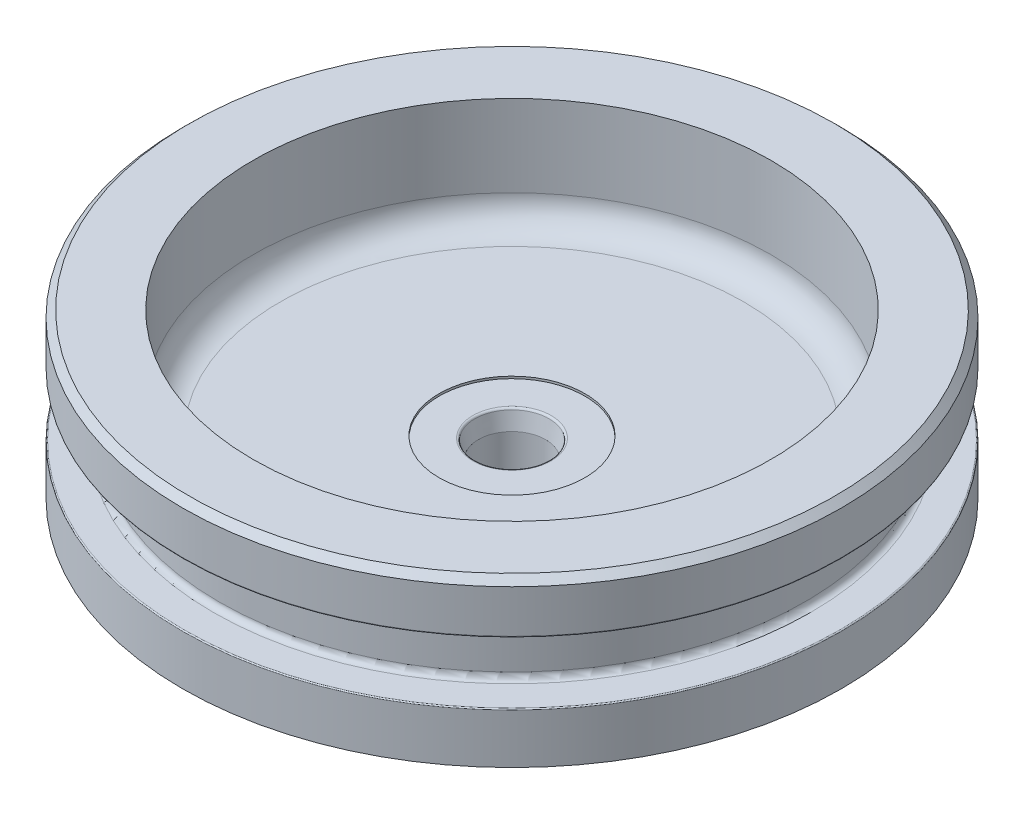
ISO-10303-21;
HEADER;
FILE_DESCRIPTION(('STEP AP214'),'2;1');
FILE_NAME('part.step','',(''),(''),'','','');
FILE_SCHEMA(('AUTOMOTIVE_DESIGN { 1 0 10303 214 1 1 1 1 }'));
ENDSEC;
DATA;
#1=APPLICATION_CONTEXT('core data for automotive mechanical design processes');
#2=APPLICATION_PROTOCOL_DEFINITION('international standard','automotive_design',2000,#1);
#3=PRODUCT_CONTEXT('',#1,'mechanical');
#4=PRODUCT('Part','Part','',(#3));
#5=PRODUCT_RELATED_PRODUCT_CATEGORY('part','',(#4));
#6=PRODUCT_DEFINITION_FORMATION('','',#4);
#7=PRODUCT_DEFINITION_CONTEXT('part definition',#1,'design');
#8=PRODUCT_DEFINITION('design','',#6,#7);
#9=PRODUCT_DEFINITION_SHAPE('','',#8);
#10=(LENGTH_UNIT() NAMED_UNIT(*) SI_UNIT(.MILLI.,.METRE.));
#11=(NAMED_UNIT(*) PLANE_ANGLE_UNIT() SI_UNIT($,.RADIAN.));
#12=(NAMED_UNIT(*) SI_UNIT($,.STERADIAN.) SOLID_ANGLE_UNIT());
#13=UNCERTAINTY_MEASURE_WITH_UNIT(LENGTH_MEASURE(1.E-05),#10,'distance_accuracy_value','');
#14=(GEOMETRIC_REPRESENTATION_CONTEXT(3) GLOBAL_UNCERTAINTY_ASSIGNED_CONTEXT((#13)) GLOBAL_UNIT_ASSIGNED_CONTEXT((#10,
#11,#12)) REPRESENTATION_CONTEXT('',''));
#15=CARTESIAN_POINT('',(0.,0.,0.));
#16=DIRECTION('',(0.,0.,1.));
#17=DIRECTION('',(1.,0.,0.));
#18=AXIS2_PLACEMENT_3D('',#15,#16,#17);
#19=CARTESIAN_POINT('',(0.,0.,0.));
#20=DIRECTION('',(0.,-1.,0.));
#21=DIRECTION('',(0.,0.,-1.));
#22=AXIS2_PLACEMENT_3D('',#19,#20,#21);
#23=CYLINDRICAL_SURFACE('',#22,38.4175);
#24=CARTESIAN_POINT('',(0.,-0.793750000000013,0.));
#25=DIRECTION('',(0.,-1.,0.));
#26=DIRECTION('',(0.,0.,-1.));
#27=AXIS2_PLACEMENT_3D('',#24,#25,#26);
#28=CIRCLE('',#27,38.4175);
#29=CARTESIAN_POINT('',(0.,-0.793750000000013,-38.4175));
#30=VERTEX_POINT('',#29);
#31=EDGE_CURVE('E497',#30,#30,#28,.T.);
#32=ORIENTED_EDGE('',*,*,#31,.T.);
#33=EDGE_LOOP('',(#32));
#34=FACE_BOUND('',#33,.T.);
#35=CARTESIAN_POINT('',(0.,-5.79755000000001,0.));
#36=DIRECTION('',(0.,1.,0.));
#37=DIRECTION('',(0.,0.,1.));
#38=AXIS2_PLACEMENT_3D('',#35,#36,#37);
#39=CIRCLE('',#38,38.4175);
#40=CARTESIAN_POINT('',(0.,-5.79755000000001,38.4175));
#41=VERTEX_POINT('',#40);
#42=EDGE_CURVE('E527',#41,#41,#39,.T.);
#43=ORIENTED_EDGE('',*,*,#42,.T.);
#44=EDGE_LOOP('',(#43));
#45=FACE_BOUND('',#44,.T.);
#46=ADVANCED_FACE('F486',(#34,#45),#23,.T.);
#47=CARTESIAN_POINT('',(0.,0.,0.));
#48=DIRECTION('',(0.,-1.,0.));
#49=DIRECTION('',(0.,0.,-1.));
#50=AXIS2_PLACEMENT_3D('',#47,#48,#49);
#51=PLANE('',#50);
#52=CARTESIAN_POINT('',(0.,0.,0.));
#53=DIRECTION('',(0.,-1.,0.));
#54=DIRECTION('',(0.,0.,-1.));
#55=AXIS2_PLACEMENT_3D('',#52,#53,#54);
#56=CIRCLE('',#55,37.62375);
#57=CARTESIAN_POINT('',(0.,0.,-37.62375));
#58=VERTEX_POINT('',#57);
#59=EDGE_CURVE('E493',#58,#58,#56,.F.);
#60=ORIENTED_EDGE('',*,*,#59,.T.);
#61=EDGE_LOOP('',(#60));
#62=FACE_BOUND('',#61,.T.);
#63=CARTESIAN_POINT('',(0.,0.,0.));
#64=DIRECTION('',(0.,-1.,0.));
#65=DIRECTION('',(0.,0.,-1.));
#66=AXIS2_PLACEMENT_3D('',#63,#64,#65);
#67=CIRCLE('',#66,30.2006);
#68=CARTESIAN_POINT('',(0.,0.,-30.2006));
#69=VERTEX_POINT('',#68);
#70=EDGE_CURVE('E524',#69,#69,#67,.T.);
#71=ORIENTED_EDGE('',*,*,#70,.T.);
#72=EDGE_LOOP('',(#71));
#73=FACE_BOUND('',#72,.T.);
#74=ADVANCED_FACE('F587',(#62,#73),#51,.F.);
#75=CARTESIAN_POINT('',(0.,-13.25245,0.));
#76=DIRECTION('',(0.,1.,0.));
#77=DIRECTION('',(0.,0.,1.));
#78=AXIS2_PLACEMENT_3D('',#75,#76,#77);
#79=CIRCLE('',#78,38.4175);
#80=CARTESIAN_POINT('',(0.,-13.25245,38.4175));
#81=VERTEX_POINT('',#80);
#82=EDGE_CURVE('E530',#81,#81,#79,.T.);
#83=ORIENTED_EDGE('',*,*,#82,.F.);
#84=EDGE_LOOP('',(#83));
#85=FACE_BOUND('',#84,.T.);
#86=CARTESIAN_POINT('',(0.,-19.05,0.));
#87=DIRECTION('',(0.,-1.,0.));
#88=DIRECTION('',(0.,0.,-1.));
#89=AXIS2_PLACEMENT_3D('',#86,#87,#88);
#90=CIRCLE('',#89,38.4175);
#91=CARTESIAN_POINT('',(0.,-19.05,-38.4175));
#92=VERTEX_POINT('',#91);
#93=EDGE_CURVE('E518',#92,#92,#90,.T.);
#94=ORIENTED_EDGE('',*,*,#93,.F.);
#95=EDGE_LOOP('',(#94));
#96=FACE_BOUND('',#95,.T.);
#97=ADVANCED_FACE('F590',(#85,#96),#23,.T.);
#98=CARTESIAN_POINT('',(-38.4175,-19.05,0.));
#99=DIRECTION('',(0.,1.,0.));
#100=DIRECTION('',(0.,0.,1.));
#101=AXIS2_PLACEMENT_3D('',#98,#99,#100);
#102=PLANE('',#101);
#103=CARTESIAN_POINT('',(0.,-19.05,0.));
#104=DIRECTION('',(0.,1.,0.));
#105=DIRECTION('',(0.,0.,1.));
#106=AXIS2_PLACEMENT_3D('',#103,#104,#105);
#107=CIRCLE('',#106,10.668);
#108=CARTESIAN_POINT('',(0.,-19.05,10.668));
#109=VERTEX_POINT('',#108);
#110=EDGE_CURVE('E515',#109,#109,#107,.F.);
#111=ORIENTED_EDGE('',*,*,#110,.F.);
#112=EDGE_LOOP('',(#111));
#113=FACE_BOUND('',#112,.T.);
#114=ORIENTED_EDGE('',*,*,#93,.T.);
#115=EDGE_LOOP('',(#114));
#116=FACE_BOUND('',#115,.T.);
#117=ADVANCED_FACE('F598',(#113,#116),#102,.F.);
#118=CARTESIAN_POINT('',(0.,-38.1,0.));
#119=DIRECTION('',(0.,-1.,0.));
#120=DIRECTION('',(0.,0.,-1.));
#121=AXIS2_PLACEMENT_3D('',#118,#119,#120);
#122=PLANE('',#121);
#123=CARTESIAN_POINT('',(0.,-38.1,0.));
#124=DIRECTION('',(0.,-1.,0.));
#125=DIRECTION('',(0.,0.,-1.));
#126=AXIS2_PLACEMENT_3D('',#123,#124,#125);
#127=CIRCLE('',#126,9.39800000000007);
#128=CARTESIAN_POINT('',(0.,-38.1,-9.39800000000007));
#129=VERTEX_POINT('',#128);
#130=EDGE_CURVE('E512',#129,#129,#127,.T.);
#131=ORIENTED_EDGE('',*,*,#130,.T.);
#132=EDGE_LOOP('',(#131));
#133=FACE_BOUND('',#132,.T.);
#134=CARTESIAN_POINT('',(0.,-38.1,0.));
#135=DIRECTION('',(0.,-1.,0.));
#136=DIRECTION('',(0.,0.,-1.));
#137=AXIS2_PLACEMENT_3D('',#134,#135,#136);
#138=CIRCLE('',#137,7.8994);
#139=CARTESIAN_POINT('',(0.,-38.1,7.8994));
#140=VERTEX_POINT('',#139);
#141=EDGE_CURVE('E521',#140,#140,#138,.T.);
#142=ORIENTED_EDGE('',*,*,#141,.F.);
#143=EDGE_LOOP('',(#142));
#144=FACE_BOUND('',#143,.T.);
#145=ADVANCED_FACE('F603',(#133,#144),#122,.T.);
#146=CARTESIAN_POINT('',(0.,-38.1,0.));
#147=DIRECTION('',(0.,1.,0.));
#148=DIRECTION('',(0.,0.,1.));
#149=AXIS2_PLACEMENT_3D('',#146,#147,#148);
#150=CYLINDRICAL_SURFACE('',#149,10.668);
#151=CARTESIAN_POINT('',(0.,-36.8300000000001,0.));
#152=DIRECTION('',(0.,-1.,0.));
#153=DIRECTION('',(0.,0.,-1.));
#154=AXIS2_PLACEMENT_3D('',#151,#152,#153);
#155=CIRCLE('',#154,10.668);
#156=CARTESIAN_POINT('',(0.,-36.8300000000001,10.668));
#157=VERTEX_POINT('',#156);
#158=EDGE_CURVE('E509',#157,#157,#155,.F.);
#159=CARTESIAN_POINT('',(0.,-36.8300000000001,10.668));
#160=CARTESIAN_POINT('',(0.,-36.6447916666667,10.668));
#161=CARTESIAN_POINT('',(0.,-36.4595833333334,10.668));
#162=CARTESIAN_POINT('',(0.,-36.0891666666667,10.668));
#163=CARTESIAN_POINT('',(0.,-35.9039583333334,10.668));
#164=CARTESIAN_POINT('',(0.,-35.5335416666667,10.668));
#165=CARTESIAN_POINT('',(0.,-35.3483333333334,10.668));
#166=CARTESIAN_POINT('',(0.,-34.9779166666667,10.668));
#167=CARTESIAN_POINT('',(0.,-34.7927083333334,10.668));
#168=CARTESIAN_POINT('',(0.,-34.4222916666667,10.668));
#169=CARTESIAN_POINT('',(0.,-34.2370833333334,10.668));
#170=CARTESIAN_POINT('',(0.,-33.8666666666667,10.668));
#171=CARTESIAN_POINT('',(0.,-33.6814583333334,10.668));
#172=CARTESIAN_POINT('',(0.,-33.3110416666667,10.668));
#173=CARTESIAN_POINT('',(0.,-33.1258333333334,10.668));
#174=CARTESIAN_POINT('',(0.,-32.7554166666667,10.668));
#175=CARTESIAN_POINT('',(0.,-32.5702083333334,10.668));
#176=CARTESIAN_POINT('',(0.,-32.1997916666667,10.668));
#177=CARTESIAN_POINT('',(0.,-32.0145833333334,10.668));
#178=CARTESIAN_POINT('',(0.,-31.6441666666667,10.668));
#179=CARTESIAN_POINT('',(0.,-31.4589583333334,10.668));
#180=CARTESIAN_POINT('',(0.,-31.0885416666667,10.668));
#181=CARTESIAN_POINT('',(0.,-30.9033333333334,10.668));
#182=CARTESIAN_POINT('',(0.,-30.5329166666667,10.668));
#183=CARTESIAN_POINT('',(0.,-30.3477083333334,10.668));
#184=CARTESIAN_POINT('',(0.,-29.9772916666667,10.668));
#185=CARTESIAN_POINT('',(0.,-29.7920833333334,10.668));
#186=CARTESIAN_POINT('',(0.,-29.4216666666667,10.668));
#187=CARTESIAN_POINT('',(0.,-29.2364583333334,10.668));
#188=CARTESIAN_POINT('',(0.,-28.8660416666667,10.668));
#189=CARTESIAN_POINT('',(0.,-28.6808333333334,10.668));
#190=CARTESIAN_POINT('',(0.,-28.3104166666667,10.668));
#191=CARTESIAN_POINT('',(0.,-28.1252083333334,10.668));
#192=CARTESIAN_POINT('',(0.,-27.7547916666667,10.668));
#193=CARTESIAN_POINT('',(0.,-27.5695833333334,10.668));
#194=CARTESIAN_POINT('',(0.,-27.1991666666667,10.668));
#195=CARTESIAN_POINT('',(0.,-27.0139583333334,10.668));
#196=CARTESIAN_POINT('',(0.,-26.6435416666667,10.668));
#197=CARTESIAN_POINT('',(0.,-26.4583333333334,10.668));
#198=CARTESIAN_POINT('',(0.,-26.0879166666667,10.668));
#199=CARTESIAN_POINT('',(0.,-25.9027083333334,10.668));
#200=CARTESIAN_POINT('',(0.,-25.5322916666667,10.668));
#201=CARTESIAN_POINT('',(0.,-25.3470833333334,10.668));
#202=CARTESIAN_POINT('',(0.,-24.9766666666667,10.668));
#203=CARTESIAN_POINT('',(0.,-24.7914583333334,10.668));
#204=CARTESIAN_POINT('',(0.,-24.4210416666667,10.668));
#205=CARTESIAN_POINT('',(0.,-24.2358333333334,10.668));
#206=CARTESIAN_POINT('',(0.,-23.8654166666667,10.668));
#207=CARTESIAN_POINT('',(0.,-23.6802083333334,10.668));
#208=CARTESIAN_POINT('',(0.,-23.3097916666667,10.668));
#209=CARTESIAN_POINT('',(0.,-23.1245833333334,10.668));
#210=CARTESIAN_POINT('',(0.,-22.7541666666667,10.668));
#211=CARTESIAN_POINT('',(0.,-22.5689583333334,10.668));
#212=CARTESIAN_POINT('',(0.,-22.1985416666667,10.668));
#213=CARTESIAN_POINT('',(0.,-22.0133333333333,10.668));
#214=CARTESIAN_POINT('',(0.,-21.6429166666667,10.668));
#215=CARTESIAN_POINT('',(0.,-21.4577083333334,10.668));
#216=CARTESIAN_POINT('',(0.,-21.0872916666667,10.668));
#217=CARTESIAN_POINT('',(0.,-20.9020833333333,10.668));
#218=CARTESIAN_POINT('',(0.,-20.5316666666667,10.668));
#219=CARTESIAN_POINT('',(0.,-20.3464583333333,10.668));
#220=CARTESIAN_POINT('',(0.,-19.9760416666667,10.668));
#221=CARTESIAN_POINT('',(0.,-19.7908333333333,10.668));
#222=CARTESIAN_POINT('',(0.,-19.4204166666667,10.668));
#223=CARTESIAN_POINT('',(0.,-19.2352083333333,10.668));
#224=CARTESIAN_POINT('',(0.,-19.05,10.668));
#225=B_SPLINE_CURVE_WITH_KNOTS('',3,(#159,#160,#161,#162,#163,#164,#165,#166,#167,#168,#169,
#170,#171,#172,#173,#174,#175,#176,#177,#178,#179,#180,#181,#182,#183,#184,#185,#186,#187,#188,
#189,#190,#191,#192,#193,#194,#195,#196,#197,#198,#199,#200,#201,#202,#203,#204,#205,#206,#207,
#208,#209,#210,#211,#212,#213,#214,#215,#216,#217,#218,#219,#220,#221,#222,#223,#224),
.UNSPECIFIED.,.F.,.F.,(4,2,2,2,2,2,2,2,2,2,2,2,2,2,2,2,2,2,2,2,2,2,2,2,2,2,2,2,2,2,2,2,4),(0.,
0.555624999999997,1.11125,1.66687500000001,2.2225,2.77812500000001,3.33375000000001,
3.88937500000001,4.44500000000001,5.00062500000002,5.55625000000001,6.11187500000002,
6.66750000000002,7.22312500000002,7.77875000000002,8.33437500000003,8.89000000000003,
9.44562500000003,10.00125,10.556875,11.1125,11.668125,12.22375,12.779375,13.335,13.890625,
14.44625,15.001875,15.5575000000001,16.113125,16.6687500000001,17.2243750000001,
17.7800000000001),.UNSPECIFIED.);
#226=EDGE_CURVE('BSEAM641',#157,#109,#225,.T.);
#227=ORIENTED_EDGE('',*,*,#158,.T.);
#228=ORIENTED_EDGE('',*,*,#110,.T.);
#229=ORIENTED_EDGE('',*,*,#226,.T.);
#230=ORIENTED_EDGE('',*,*,#226,.F.);
#231=EDGE_LOOP('',(#227,#229,#228,#230));
#232=FACE_BOUND('',#231,.T.);
#233=ADVANCED_FACE('F641',(#232),#150,.T.);
#234=CARTESIAN_POINT('',(0.,-38.1,0.));
#235=DIRECTION('',(0.,1.,0.));
#236=DIRECTION('',(0.,0.,1.));
#237=AXIS2_PLACEMENT_3D('',#234,#235,#236);
#238=CYLINDRICAL_SURFACE('',#237,7.8994);
#239=CARTESIAN_POINT('',(0.,-25.4,0.));
#240=DIRECTION('',(0.,-1.,0.));
#241=DIRECTION('',(0.,0.,-1.));
#242=AXIS2_PLACEMENT_3D('',#239,#240,#241);
#243=CIRCLE('',#242,7.8994);
#244=CARTESIAN_POINT('',(0.,-25.4,7.8994));
#245=VERTEX_POINT('',#244);
#246=EDGE_CURVE('E14',#245,#245,#243,.T.);
#247=CARTESIAN_POINT('',(0.,-25.4,7.8994));
#248=CARTESIAN_POINT('',(0.,-25.5322916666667,7.8994));
#249=CARTESIAN_POINT('',(0.,-25.6645833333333,7.8994));
#250=CARTESIAN_POINT('',(0.,-25.9291666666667,7.8994));
#251=CARTESIAN_POINT('',(0.,-26.0614583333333,7.8994));
#252=CARTESIAN_POINT('',(0.,-26.3260416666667,7.8994));
#253=CARTESIAN_POINT('',(0.,-26.4583333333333,7.8994));
#254=CARTESIAN_POINT('',(0.,-26.7229166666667,7.8994));
#255=CARTESIAN_POINT('',(0.,-26.8552083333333,7.8994));
#256=CARTESIAN_POINT('',(0.,-27.1197916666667,7.8994));
#257=CARTESIAN_POINT('',(0.,-27.2520833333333,7.8994));
#258=CARTESIAN_POINT('',(0.,-27.5166666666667,7.8994));
#259=CARTESIAN_POINT('',(0.,-27.6489583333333,7.8994));
#260=CARTESIAN_POINT('',(0.,-27.9135416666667,7.8994));
#261=CARTESIAN_POINT('',(0.,-28.0458333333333,7.8994));
#262=CARTESIAN_POINT('',(0.,-28.3104166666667,7.8994));
#263=CARTESIAN_POINT('',(0.,-28.4427083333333,7.8994));
#264=CARTESIAN_POINT('',(0.,-28.7072916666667,7.8994));
#265=CARTESIAN_POINT('',(0.,-28.8395833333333,7.8994));
#266=CARTESIAN_POINT('',(0.,-29.1041666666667,7.8994));
#267=CARTESIAN_POINT('',(0.,-29.2364583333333,7.8994));
#268=CARTESIAN_POINT('',(0.,-29.5010416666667,7.8994));
#269=CARTESIAN_POINT('',(0.,-29.6333333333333,7.8994));
#270=CARTESIAN_POINT('',(0.,-29.8979166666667,7.8994));
#271=CARTESIAN_POINT('',(0.,-30.0302083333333,7.8994));
#272=CARTESIAN_POINT('',(0.,-30.2947916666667,7.8994));
#273=CARTESIAN_POINT('',(0.,-30.4270833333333,7.8994));
#274=CARTESIAN_POINT('',(0.,-30.6916666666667,7.8994));
#275=CARTESIAN_POINT('',(0.,-30.8239583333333,7.8994));
#276=CARTESIAN_POINT('',(0.,-31.0885416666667,7.8994));
#277=CARTESIAN_POINT('',(0.,-31.2208333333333,7.8994));
#278=CARTESIAN_POINT('',(0.,-31.4854166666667,7.8994));
#279=CARTESIAN_POINT('',(0.,-31.6177083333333,7.8994));
#280=CARTESIAN_POINT('',(0.,-31.8822916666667,7.8994));
#281=CARTESIAN_POINT('',(0.,-32.0145833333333,7.8994));
#282=CARTESIAN_POINT('',(0.,-32.2791666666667,7.8994));
#283=CARTESIAN_POINT('',(0.,-32.4114583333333,7.8994));
#284=CARTESIAN_POINT('',(0.,-32.6760416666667,7.8994));
#285=CARTESIAN_POINT('',(0.,-32.8083333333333,7.8994));
#286=CARTESIAN_POINT('',(0.,-33.0729166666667,7.8994));
#287=CARTESIAN_POINT('',(0.,-33.2052083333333,7.8994));
#288=CARTESIAN_POINT('',(0.,-33.4697916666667,7.8994));
#289=CARTESIAN_POINT('',(0.,-33.6020833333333,7.8994));
#290=CARTESIAN_POINT('',(0.,-33.8666666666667,7.8994));
#291=CARTESIAN_POINT('',(0.,-33.9989583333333,7.8994));
#292=CARTESIAN_POINT('',(0.,-34.2635416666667,7.8994));
#293=CARTESIAN_POINT('',(0.,-34.3958333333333,7.8994));
#294=CARTESIAN_POINT('',(0.,-34.6604166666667,7.8994));
#295=CARTESIAN_POINT('',(0.,-34.7927083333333,7.8994));
#296=CARTESIAN_POINT('',(0.,-35.0572916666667,7.8994));
#297=CARTESIAN_POINT('',(0.,-35.1895833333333,7.8994));
#298=CARTESIAN_POINT('',(0.,-35.4541666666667,7.8994));
#299=CARTESIAN_POINT('',(0.,-35.5864583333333,7.8994));
#300=CARTESIAN_POINT('',(0.,-35.8510416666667,7.8994));
#301=CARTESIAN_POINT('',(0.,-35.9833333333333,7.8994));
#302=CARTESIAN_POINT('',(0.,-36.2479166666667,7.8994));
#303=CARTESIAN_POINT('',(0.,-36.3802083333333,7.8994));
#304=CARTESIAN_POINT('',(0.,-36.6447916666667,7.8994));
#305=CARTESIAN_POINT('',(0.,-36.7770833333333,7.8994));
#306=CARTESIAN_POINT('',(0.,-37.0416666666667,7.8994));
#307=CARTESIAN_POINT('',(0.,-37.1739583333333,7.8994));
#308=CARTESIAN_POINT('',(0.,-37.4385416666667,7.8994));
#309=CARTESIAN_POINT('',(0.,-37.5708333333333,7.8994));
#310=CARTESIAN_POINT('',(0.,-37.8354166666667,7.8994));
#311=CARTESIAN_POINT('',(0.,-37.9677083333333,7.8994));
#312=CARTESIAN_POINT('',(0.,-38.1,7.8994));
#313=B_SPLINE_CURVE_WITH_KNOTS('',3,(#247,#248,#249,#250,#251,#252,#253,#254,#255,#256,#257,
#258,#259,#260,#261,#262,#263,#264,#265,#266,#267,#268,#269,#270,#271,#272,#273,#274,#275,#276,
#277,#278,#279,#280,#281,#282,#283,#284,#285,#286,#287,#288,#289,#290,#291,#292,#293,#294,#295,
#296,#297,#298,#299,#300,#301,#302,#303,#304,#305,#306,#307,#308,#309,#310,#311,#312),
.UNSPECIFIED.,.F.,.F.,(4,2,2,2,2,2,2,2,2,2,2,2,2,2,2,2,2,2,2,2,2,2,2,2,2,2,2,2,2,2,2,2,4),(0.,
0.396874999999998,0.793749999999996,1.190625,1.5875,1.984375,2.38125,2.778125,3.175,3.571875,
3.96875,4.365625,4.7625,5.159375,5.55625,5.953125,6.35,6.746875,7.14375,7.540625,7.9375,
8.334375,8.73125,9.128125,9.525,9.921875,10.31875,10.715625,11.1125,11.509375,11.90625,
12.303125,12.7),.UNSPECIFIED.);
#314=EDGE_CURVE('BSEAM638',#245,#140,#313,.T.);
#315=ORIENTED_EDGE('',*,*,#246,.F.);
#316=ORIENTED_EDGE('',*,*,#141,.T.);
#317=ORIENTED_EDGE('',*,*,#314,.T.);
#318=ORIENTED_EDGE('',*,*,#314,.F.);
#319=EDGE_LOOP('',(#315,#317,#316,#318));
#320=FACE_BOUND('',#319,.T.);
#321=ADVANCED_FACE('F638',(#320),#238,.F.);
#322=CARTESIAN_POINT('',(0.,-38.1,0.));
#323=DIRECTION('',(0.,1.,0.));
#324=DIRECTION('',(0.,0.,1.));
#325=AXIS2_PLACEMENT_3D('',#322,#323,#324);
#326=CONICAL_SURFACE('',#325,9.39800000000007,0.785398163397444);
#327=ORIENTED_EDGE('',*,*,#158,.F.);
#328=EDGE_LOOP('',(#327));
#329=FACE_BOUND('',#328,.T.);
#330=ORIENTED_EDGE('',*,*,#130,.F.);
#331=EDGE_LOOP('',(#330));
#332=FACE_BOUND('',#331,.T.);
#333=ADVANCED_FACE('F636',(#329,#332),#326,.T.);
#334=CARTESIAN_POINT('',(0.,-12.7,0.));
#335=DIRECTION('',(0.,-1.,0.));
#336=DIRECTION('',(0.,0.,-1.));
#337=AXIS2_PLACEMENT_3D('',#334,#335,#336);
#338=PLANE('',#337);
#339=CARTESIAN_POINT('',(0.,-12.7,0.));
#340=DIRECTION('',(0.,1.,0.));
#341=DIRECTION('',(0.,0.,1.));
#342=AXIS2_PLACEMENT_3D('',#339,#340,#341);
#343=CIRCLE('',#342,8.49999999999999);
#344=CARTESIAN_POINT('',(0.,-12.7,8.49999999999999));
#345=VERTEX_POINT('',#344);
#346=EDGE_CURVE('E551',#345,#345,#343,.T.);
#347=ORIENTED_EDGE('',*,*,#346,.F.);
#348=EDGE_LOOP('',(#347));
#349=FACE_BOUND('',#348,.T.);
#350=CARTESIAN_POINT('',(0.,-12.7,0.));
#351=DIRECTION('',(0.,-1.,0.));
#352=DIRECTION('',(0.,0.,-1.));
#353=AXIS2_PLACEMENT_3D('',#350,#351,#352);
#354=CIRCLE('',#353,27.0256);
#355=CARTESIAN_POINT('',(0.,-12.7,-27.0256));
#356=VERTEX_POINT('',#355);
#357=EDGE_CURVE('E501',#356,#356,#354,.F.);
#358=ORIENTED_EDGE('',*,*,#357,.T.);
#359=EDGE_LOOP('',(#358));
#360=FACE_BOUND('',#359,.T.);
#361=ADVANCED_FACE('F632',(#349,#360),#338,.F.);
#362=CARTESIAN_POINT('',(0.,-110.82019622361,0.));
#363=DIRECTION('',(0.,1.,0.));
#364=DIRECTION('',(0.,0.,1.));
#365=AXIS2_PLACEMENT_3D('',#362,#363,#364);
#366=CYLINDRICAL_SURFACE('',#365,30.2006);
#367=CARTESIAN_POINT('',(0.,-9.52500000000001,0.));
#368=DIRECTION('',(0.,-1.,0.));
#369=DIRECTION('',(0.,0.,-1.));
#370=AXIS2_PLACEMENT_3D('',#367,#368,#369);
#371=CIRCLE('',#370,30.2006);
#372=CARTESIAN_POINT('',(0.,-9.52500000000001,-30.2006));
#373=VERTEX_POINT('',#372);
#374=EDGE_CURVE('E506',#373,#373,#371,.T.);
#375=ORIENTED_EDGE('',*,*,#374,.T.);
#376=EDGE_LOOP('',(#375));
#377=FACE_BOUND('',#376,.T.);
#378=ORIENTED_EDGE('',*,*,#70,.F.);
#379=EDGE_LOOP('',(#378));
#380=FACE_BOUND('',#379,.T.);
#381=ADVANCED_FACE('F629',(#377,#380),#366,.F.);
#382=CARTESIAN_POINT('',(0.,-9.52500000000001,0.));
#383=DIRECTION('',(0.,-1.,0.));
#384=DIRECTION('',(0.,0.,-1.));
#385=AXIS2_PLACEMENT_3D('',#382,#383,#384);
#386=TOROIDAL_SURFACE('',#385,27.0256,3.175);
#387=ORIENTED_EDGE('',*,*,#357,.F.);
#388=EDGE_LOOP('',(#387));
#389=FACE_BOUND('',#388,.T.);
#390=ORIENTED_EDGE('',*,*,#374,.F.);
#391=EDGE_LOOP('',(#390));
#392=FACE_BOUND('',#391,.T.);
#393=ADVANCED_FACE('F623',(#389,#392),#386,.F.);
#394=CARTESIAN_POINT('',(0.,-5.79755,0.));
#395=DIRECTION('',(0.,1.,0.));
#396=DIRECTION('',(0.,0.,1.));
#397=AXIS2_PLACEMENT_3D('',#394,#395,#396);
#398=TOROIDAL_SURFACE('',#397,38.2905,0.127000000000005);
#399=ORIENTED_EDGE('',*,*,#42,.F.);
#400=EDGE_LOOP('',(#399));
#401=FACE_BOUND('',#400,.T.);
#402=CARTESIAN_POINT('',(0.,-5.92455,0.));
#403=DIRECTION('',(0.,1.,0.));
#404=DIRECTION('',(0.,0.,1.));
#405=AXIS2_PLACEMENT_3D('',#402,#403,#404);
#406=CIRCLE('',#405,38.2905);
#407=CARTESIAN_POINT('',(0.,-5.92455,38.2905));
#408=VERTEX_POINT('',#407);
#409=EDGE_CURVE('E548',#408,#408,#406,.T.);
#410=ORIENTED_EDGE('',*,*,#409,.T.);
#411=EDGE_LOOP('',(#410));
#412=FACE_BOUND('',#411,.T.);
#413=ADVANCED_FACE('F613',(#401,#412),#398,.T.);
#414=CARTESIAN_POINT('',(0.,-13.25245,0.));
#415=DIRECTION('',(0.,1.,0.));
#416=DIRECTION('',(0.,0.,1.));
#417=AXIS2_PLACEMENT_3D('',#414,#415,#416);
#418=TOROIDAL_SURFACE('',#417,38.2905,0.127000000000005);
#419=CARTESIAN_POINT('',(0.,-13.12545,0.));
#420=DIRECTION('',(0.,1.,0.));
#421=DIRECTION('',(0.,0.,1.));
#422=AXIS2_PLACEMENT_3D('',#419,#420,#421);
#423=CIRCLE('',#422,38.2905);
#424=CARTESIAN_POINT('',(0.,-13.12545,38.2905));
#425=VERTEX_POINT('',#424);
#426=EDGE_CURVE('E533',#425,#425,#423,.T.);
#427=ORIENTED_EDGE('',*,*,#426,.F.);
#428=EDGE_LOOP('',(#427));
#429=FACE_BOUND('',#428,.T.);
#430=ORIENTED_EDGE('',*,*,#82,.T.);
#431=EDGE_LOOP('',(#430));
#432=FACE_BOUND('',#431,.T.);
#433=ADVANCED_FACE('F610',(#429,#432),#418,.T.);
#434=CARTESIAN_POINT('',(0.,-13.12545,-34.8361));
#435=DIRECTION('',(0.,-1.,0.));
#436=DIRECTION('',(0.,0.,-1.));
#437=AXIS2_PLACEMENT_3D('',#434,#435,#436);
#438=PLANE('',#437);
#439=CARTESIAN_POINT('',(0.,-13.12545,0.));
#440=DIRECTION('',(0.,1.,0.));
#441=DIRECTION('',(0.,0.,1.));
#442=AXIS2_PLACEMENT_3D('',#439,#440,#441);
#443=CIRCLE('',#442,34.8361);
#444=CARTESIAN_POINT('',(0.,-13.12545,34.8361));
#445=VERTEX_POINT('',#444);
#446=EDGE_CURVE('E536',#445,#445,#443,.T.);
#447=ORIENTED_EDGE('',*,*,#446,.F.);
#448=EDGE_LOOP('',(#447));
#449=FACE_BOUND('',#448,.T.);
#450=ORIENTED_EDGE('',*,*,#426,.T.);
#451=EDGE_LOOP('',(#450));
#452=FACE_BOUND('',#451,.T.);
#453=ADVANCED_FACE('F612',(#449,#452),#438,.F.);
#454=CARTESIAN_POINT('',(0.,-12.42695,0.));
#455=DIRECTION('',(0.,1.,0.));
#456=DIRECTION('',(0.,0.,1.));
#457=AXIS2_PLACEMENT_3D('',#454,#455,#456);
#458=TOROIDAL_SURFACE('',#457,34.8361,0.698499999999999);
#459=CARTESIAN_POINT('',(0.,-12.42695,0.));
#460=DIRECTION('',(0.,1.,0.));
#461=DIRECTION('',(0.,0.,1.));
#462=AXIS2_PLACEMENT_3D('',#459,#460,#461);
#463=CIRCLE('',#462,34.1376);
#464=CARTESIAN_POINT('',(0.,-12.42695,34.1376));
#465=VERTEX_POINT('',#464);
#466=EDGE_CURVE('E539',#465,#465,#463,.T.);
#467=ORIENTED_EDGE('',*,*,#466,.F.);
#468=EDGE_LOOP('',(#467));
#469=FACE_BOUND('',#468,.T.);
#470=ORIENTED_EDGE('',*,*,#446,.T.);
#471=EDGE_LOOP('',(#470));
#472=FACE_BOUND('',#471,.T.);
#473=ADVANCED_FACE('F620',(#469,#472),#458,.F.);
#474=CARTESIAN_POINT('',(0.,-50.,0.));
#475=DIRECTION('',(0.,1.,0.));
#476=DIRECTION('',(0.,0.,1.));
#477=AXIS2_PLACEMENT_3D('',#474,#475,#476);
#478=CYLINDRICAL_SURFACE('',#477,34.1376);
#479=CARTESIAN_POINT('',(0.,-6.62305000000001,0.));
#480=DIRECTION('',(0.,1.,0.));
#481=DIRECTION('',(0.,0.,1.));
#482=AXIS2_PLACEMENT_3D('',#479,#480,#481);
#483=CIRCLE('',#482,34.1376);
#484=CARTESIAN_POINT('',(0.,-6.62305000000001,34.1376));
#485=VERTEX_POINT('',#484);
#486=EDGE_CURVE('E542',#485,#485,#483,.T.);
#487=ORIENTED_EDGE('',*,*,#486,.F.);
#488=EDGE_LOOP('',(#487));
#489=FACE_BOUND('',#488,.T.);
#490=ORIENTED_EDGE('',*,*,#466,.T.);
#491=EDGE_LOOP('',(#490));
#492=FACE_BOUND('',#491,.T.);
#493=ADVANCED_FACE('F695',(#489,#492),#478,.T.);
#494=CARTESIAN_POINT('',(0.,-6.62305,0.));
#495=DIRECTION('',(0.,1.,0.));
#496=DIRECTION('',(0.,0.,1.));
#497=AXIS2_PLACEMENT_3D('',#494,#495,#496);
#498=TOROIDAL_SURFACE('',#497,34.8361,0.698499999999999);
#499=CARTESIAN_POINT('',(0.,-5.92455,0.));
#500=DIRECTION('',(0.,1.,0.));
#501=DIRECTION('',(0.,0.,1.));
#502=AXIS2_PLACEMENT_3D('',#499,#500,#501);
#503=CIRCLE('',#502,34.8361);
#504=CARTESIAN_POINT('',(0.,-5.92455,34.8361));
#505=VERTEX_POINT('',#504);
#506=EDGE_CURVE('E545',#505,#505,#503,.T.);
#507=ORIENTED_EDGE('',*,*,#506,.F.);
#508=EDGE_LOOP('',(#507));
#509=FACE_BOUND('',#508,.T.);
#510=ORIENTED_EDGE('',*,*,#486,.T.);
#511=EDGE_LOOP('',(#510));
#512=FACE_BOUND('',#511,.T.);
#513=ADVANCED_FACE('F702',(#509,#512),#498,.F.);
#514=CARTESIAN_POINT('',(0.,-5.92455,-34.8361));
#515=DIRECTION('',(0.,1.,0.));
#516=DIRECTION('',(0.,0.,1.));
#517=AXIS2_PLACEMENT_3D('',#514,#515,#516);
#518=PLANE('',#517);
#519=ORIENTED_EDGE('',*,*,#409,.F.);
#520=EDGE_LOOP('',(#519));
#521=FACE_BOUND('',#520,.T.);
#522=ORIENTED_EDGE('',*,*,#506,.T.);
#523=EDGE_LOOP('',(#522));
#524=FACE_BOUND('',#523,.T.);
#525=ADVANCED_FACE('F710',(#521,#524),#518,.F.);
#526=CARTESIAN_POINT('',(0.,-0.793750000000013,0.));
#527=DIRECTION('',(0.,-1.,0.));
#528=DIRECTION('',(0.,0.,-1.));
#529=AXIS2_PLACEMENT_3D('',#526,#527,#528);
#530=CONICAL_SURFACE('',#529,38.4175,0.785398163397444);
#531=ORIENTED_EDGE('',*,*,#59,.F.);
#532=EDGE_LOOP('',(#531));
#533=FACE_BOUND('',#532,.T.);
#534=ORIENTED_EDGE('',*,*,#31,.F.);
#535=EDGE_LOOP('',(#534));
#536=FACE_BOUND('',#535,.T.);
#537=ADVANCED_FACE('F488',(#533,#536),#530,.T.);
#538=CARTESIAN_POINT('',(0.,0.,0.));
#539=DIRECTION('',(0.,1.,0.));
#540=DIRECTION('',(0.,0.,1.));
#541=AXIS2_PLACEMENT_3D('',#538,#539,#540);
#542=CYLINDRICAL_SURFACE('',#541,3.96874999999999);
#543=CARTESIAN_POINT('',(0.,-15.0081960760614,0.));
#544=DIRECTION('',(0.,1.,0.));
#545=DIRECTION('',(0.,0.,1.));
#546=AXIS2_PLACEMENT_3D('',#543,#544,#545);
#547=CIRCLE('',#546,3.96874999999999);
#548=CARTESIAN_POINT('',(0.,-15.0081960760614,3.96874999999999));
#549=VERTEX_POINT('',#548);
#550=EDGE_CURVE('E566',#549,#549,#547,.T.);
#551=ORIENTED_EDGE('',*,*,#550,.T.);
#552=EDGE_LOOP('',(#551));
#553=FACE_BOUND('',#552,.T.);
#554=CARTESIAN_POINT('',(0.,-25.4,0.));
#555=DIRECTION('',(0.,-1.,0.));
#556=DIRECTION('',(0.,0.,-1.));
#557=AXIS2_PLACEMENT_3D('',#554,#555,#556);
#558=CIRCLE('',#557,3.96874999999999);
#559=CARTESIAN_POINT('',(0.,-25.4,-3.96874999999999));
#560=VERTEX_POINT('',#559);
#561=EDGE_CURVE('E569',#560,#560,#558,.T.);
#562=ORIENTED_EDGE('',*,*,#561,.T.);
#563=EDGE_LOOP('',(#562));
#564=FACE_BOUND('',#563,.T.);
#565=ADVANCED_FACE('F573',(#553,#564),#542,.F.);
#566=CARTESIAN_POINT('',(0.,0.,0.));
#567=DIRECTION('',(0.,1.,0.));
#568=DIRECTION('',(0.,0.,1.));
#569=AXIS2_PLACEMENT_3D('',#566,#567,#568);
#570=CYLINDRICAL_SURFACE('',#569,8.49999999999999);
#571=ORIENTED_EDGE('',*,*,#346,.T.);
#572=EDGE_LOOP('',(#571));
#573=FACE_BOUND('',#572,.T.);
#574=CARTESIAN_POINT('',(0.,-12.954,0.));
#575=DIRECTION('',(0.,1.,0.));
#576=DIRECTION('',(0.,0.,1.));
#577=AXIS2_PLACEMENT_3D('',#574,#575,#576);
#578=CIRCLE('',#577,8.49999999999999);
#579=CARTESIAN_POINT('',(0.,-12.954,8.49999999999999));
#580=VERTEX_POINT('',#579);
#581=EDGE_CURVE('E554',#580,#580,#578,.T.);
#582=ORIENTED_EDGE('',*,*,#581,.F.);
#583=EDGE_LOOP('',(#582));
#584=FACE_BOUND('',#583,.T.);
#585=ADVANCED_FACE('F732',(#573,#584),#570,.F.);
#586=CARTESIAN_POINT('',(4.575,-12.954,0.));
#587=DIRECTION('',(0.,1.,0.));
#588=DIRECTION('',(0.,0.,1.));
#589=AXIS2_PLACEMENT_3D('',#586,#587,#588);
#590=PLANE('',#589);
#591=ORIENTED_EDGE('',*,*,#581,.T.);
#592=EDGE_LOOP('',(#591));
#593=FACE_BOUND('',#592,.T.);
#594=CARTESIAN_POINT('',(0.,-12.954,0.));
#595=DIRECTION('',(0.,1.,0.));
#596=DIRECTION('',(0.,0.,1.));
#597=AXIS2_PLACEMENT_3D('',#594,#595,#596);
#598=CIRCLE('',#597,4.575);
#599=CARTESIAN_POINT('',(0.,-12.954,4.575));
#600=VERTEX_POINT('',#599);
#601=EDGE_CURVE('E557',#600,#600,#598,.T.);
#602=ORIENTED_EDGE('',*,*,#601,.F.);
#603=EDGE_LOOP('',(#602));
#604=FACE_BOUND('',#603,.T.);
#605=ADVANCED_FACE('F741',(#593,#604),#590,.T.);
#606=CARTESIAN_POINT('',(0.,-13.208,0.));
#607=DIRECTION('',(0.,1.,0.));
#608=DIRECTION('',(0.,0.,1.));
#609=AXIS2_PLACEMENT_3D('',#606,#607,#608);
#610=TOROIDAL_SURFACE('',#609,4.575,0.254000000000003);
#611=ORIENTED_EDGE('',*,*,#601,.T.);
#612=EDGE_LOOP('',(#611));
#613=FACE_BOUND('',#612,.T.);
#614=CARTESIAN_POINT('',(0.,-13.1551904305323,0.));
#615=DIRECTION('',(0.,1.,0.));
#616=DIRECTION('',(0.,0.,1.));
#617=AXIS2_PLACEMENT_3D('',#614,#615,#616);
#618=CIRCLE('',#617,4.32655050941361);
#619=CARTESIAN_POINT('',(0.,-13.1551904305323,4.32655050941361));
#620=VERTEX_POINT('',#619);
#621=EDGE_CURVE('E560',#620,#620,#618,.T.);
#622=ORIENTED_EDGE('',*,*,#621,.F.);
#623=EDGE_LOOP('',(#622));
#624=FACE_BOUND('',#623,.T.);
#625=ADVANCED_FACE('F749',(#613,#624),#610,.T.);
#626=CARTESIAN_POINT('',(0.,-15.054,0.));
#627=DIRECTION('',(0.,1.,0.));
#628=DIRECTION('',(0.,0.,1.));
#629=AXIS2_PLACEMENT_3D('',#626,#627,#628);
#630=CONICAL_SURFACE('',#629,3.92294607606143,0.209439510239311);
#631=ORIENTED_EDGE('',*,*,#621,.T.);
#632=EDGE_LOOP('',(#631));
#633=FACE_BOUND('',#632,.T.);
#634=CARTESIAN_POINT('',(0.,-15.054,0.));
#635=DIRECTION('',(0.,1.,0.));
#636=DIRECTION('',(0.,0.,1.));
#637=AXIS2_PLACEMENT_3D('',#634,#635,#636);
#638=CIRCLE('',#637,3.92294607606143);
#639=CARTESIAN_POINT('',(0.,-15.054,3.92294607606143));
#640=VERTEX_POINT('',#639);
#641=EDGE_CURVE('E563',#640,#640,#638,.T.);
#642=ORIENTED_EDGE('',*,*,#641,.F.);
#643=EDGE_LOOP('',(#642));
#644=FACE_BOUND('',#643,.T.);
#645=ADVANCED_FACE('F582',(#633,#644),#630,.F.);
#646=CARTESIAN_POINT('',(0.,-15.0081960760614,0.));
#647=DIRECTION('',(0.,1.,0.));
#648=DIRECTION('',(0.,0.,1.));
#649=AXIS2_PLACEMENT_3D('',#646,#647,#648);
#650=CONICAL_SURFACE('',#649,3.96874999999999,0.785398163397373);
#651=ORIENTED_EDGE('',*,*,#641,.T.);
#652=EDGE_LOOP('',(#651));
#653=FACE_BOUND('',#652,.T.);
#654=ORIENTED_EDGE('',*,*,#550,.F.);
#655=EDGE_LOOP('',(#654));
#656=FACE_BOUND('',#655,.T.);
#657=ADVANCED_FACE('F577',(#653,#656),#650,.T.);
#658=CARTESIAN_POINT('',(0.,-25.4,0.));
#659=DIRECTION('',(0.,-1.,0.));
#660=DIRECTION('',(0.,0.,-1.));
#661=AXIS2_PLACEMENT_3D('',#658,#659,#660);
#662=PLANE('',#661);
#663=ORIENTED_EDGE('',*,*,#246,.T.);
#664=EDGE_LOOP('',(#663));
#665=FACE_BOUND('',#664,.T.);
#666=ORIENTED_EDGE('',*,*,#561,.F.);
#667=EDGE_LOOP('',(#666));
#668=FACE_BOUND('',#667,.T.);
#669=ADVANCED_FACE('F575',(#665,#668),#662,.T.);
#670=CLOSED_SHELL('',(#46,#74,#97,#117,#145,#233,#321,#333,#361,#381,#393,#413,#433,#453,#473,
#493,#513,#525,#537,#565,#585,#605,#625,#645,#657,#669));
#671=MANIFOLD_SOLID_BREP('B2',#670);
#672=ADVANCED_BREP_SHAPE_REPRESENTATION('',(#18,#671),#14);
#673=SHAPE_DEFINITION_REPRESENTATION(#9,#672);
ENDSEC;
END-ISO-10303-21;
